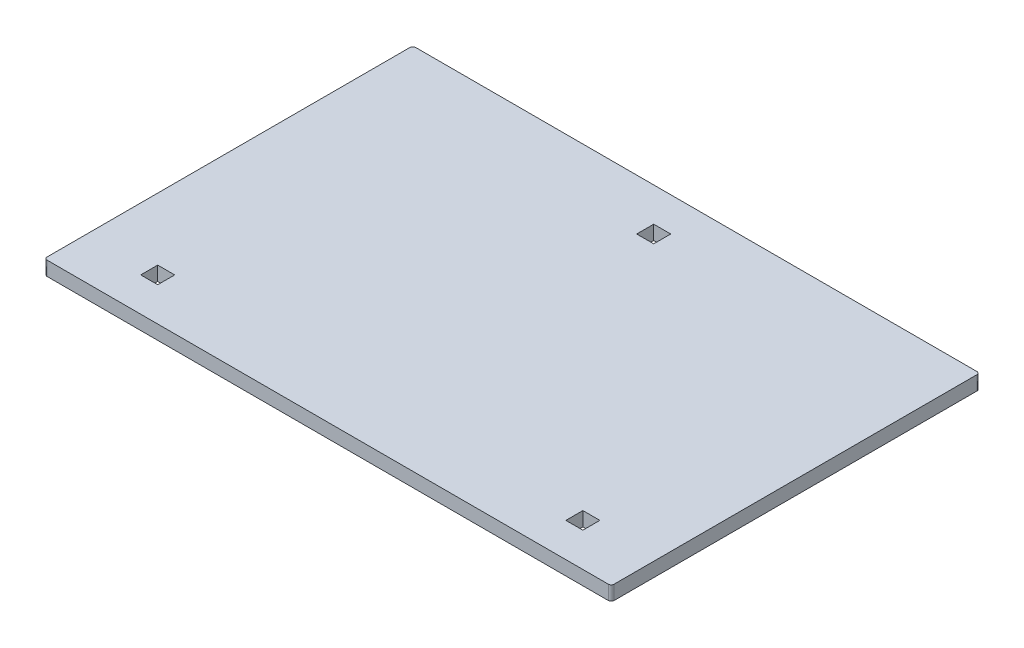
from build123d import *

# Parameters (mm, degrees)
SKETCH1_W           = 6
SKETCH1_H           = 6
BOSS_EXTRUDE1_DEPTH = 5
FILLET1_R           = 1


with BuildPart() as part:
    # Sketch1 → Boss-Extrude1 (new body)
    with BuildSketch(Plane(origin=(0, 0, 0), x_dir=(1, 0, 0), z_dir=(0, 1, 0))):
        Polygon((97.45, -130), (102.55, -130), (200, -130), (200, 0), (0, 0), (0, -130), align=None)
        Polygon((100, -12), (103, -12), (103, -18), (100, -18), (97, -18), (97, -12), align=None, mode=Mode.SUBTRACT)
        with Locations((25, -115)):
            Rectangle(SKETCH1_W, SKETCH1_H, mode=Mode.SUBTRACT)
        with Locations((175, -115)):
            Rectangle(SKETCH1_W, SKETCH1_H, mode=Mode.SUBTRACT)
    extrude(amount=BOSS_EXTRUDE1_DEPTH)

    # Fillet1
    fillet1_edges = [part.edges().sort_by_distance(p)[0] for p in [
        (0, 2.5, 0),
        (200, 2.5, 0),
        (200, 2.5, 130),
        (0, 2.5, 130),
    ]]
    fillet(fillet1_edges, radius=FILLET1_R)


solid = part.part
